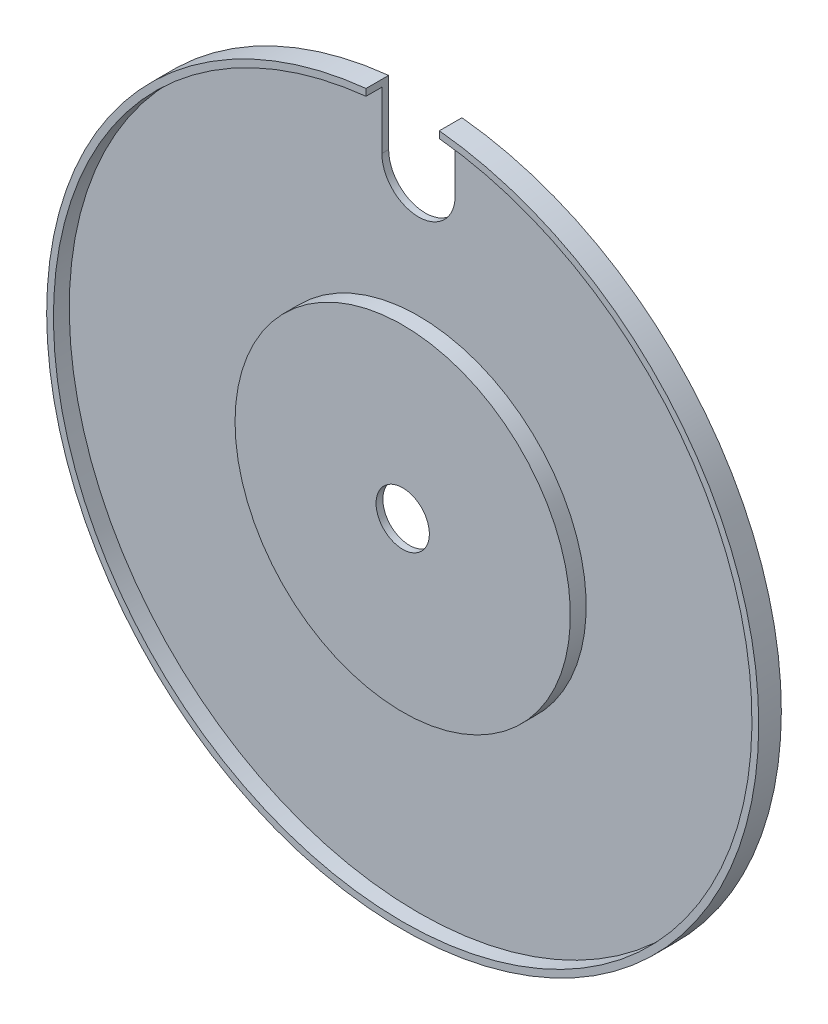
ISO-10303-21;
HEADER;
FILE_DESCRIPTION(('STEP AP214'),'2;1');
FILE_NAME('part.step','',(''),(''),'','','');
FILE_SCHEMA(('AUTOMOTIVE_DESIGN { 1 0 10303 214 1 1 1 1 }'));
ENDSEC;
DATA;
#1=APPLICATION_CONTEXT('core data for automotive mechanical design processes');
#2=APPLICATION_PROTOCOL_DEFINITION('international standard','automotive_design',2000,#1);
#3=PRODUCT_CONTEXT('',#1,'mechanical');
#4=PRODUCT('Part','Part','',(#3));
#5=PRODUCT_RELATED_PRODUCT_CATEGORY('part','',(#4));
#6=PRODUCT_DEFINITION_FORMATION('','',#4);
#7=PRODUCT_DEFINITION_CONTEXT('part definition',#1,'design');
#8=PRODUCT_DEFINITION('design','',#6,#7);
#9=PRODUCT_DEFINITION_SHAPE('','',#8);
#10=(LENGTH_UNIT() NAMED_UNIT(*) SI_UNIT(.MILLI.,.METRE.));
#11=(NAMED_UNIT(*) PLANE_ANGLE_UNIT() SI_UNIT($,.RADIAN.));
#12=(NAMED_UNIT(*) SI_UNIT($,.STERADIAN.) SOLID_ANGLE_UNIT());
#13=UNCERTAINTY_MEASURE_WITH_UNIT(LENGTH_MEASURE(1.E-05),#10,'distance_accuracy_value','');
#14=(GEOMETRIC_REPRESENTATION_CONTEXT(3) GLOBAL_UNCERTAINTY_ASSIGNED_CONTEXT((#13)) GLOBAL_UNIT_ASSIGNED_CONTEXT((#10,
#11,#12)) REPRESENTATION_CONTEXT('',''));
#15=CARTESIAN_POINT('',(0.,0.,0.));
#16=DIRECTION('',(0.,0.,1.));
#17=DIRECTION('',(1.,0.,0.));
#18=AXIS2_PLACEMENT_3D('',#15,#16,#17);
#19=CARTESIAN_POINT('',(0.,0.,1.93523572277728));
#20=DIRECTION('',(0.,0.,1.));
#21=DIRECTION('',(1.,0.,0.));
#22=AXIS2_PLACEMENT_3D('',#19,#20,#21);
#23=PLANE('',#22);
#24=DIRECTION('',(0.,-1.,0.));
#25=VECTOR('',#24,1.);
#26=CARTESIAN_POINT('',(-4.11854366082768,0.,1.93523572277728));
#27=LINE('',#26,#25);
#28=CARTESIAN_POINT('',(-4.11854366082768,39.7924317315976,1.93523572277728));
#29=VERTEX_POINT('',#28);
#30=CARTESIAN_POINT('',(-4.11854366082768,39.0262814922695,1.93523572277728));
#31=VERTEX_POINT('',#30);
#32=EDGE_CURVE('E152',#29,#31,#27,.T.);
#33=ORIENTED_EDGE('',*,*,#32,.F.);
#34=CARTESIAN_POINT('',(0.,0.,1.93523572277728));
#35=DIRECTION('',(0.,0.,-1.));
#36=DIRECTION('',(-1.,0.,0.));
#37=AXIS2_PLACEMENT_3D('',#34,#35,#36);
#38=CIRCLE('',#37,40.005);
#39=CARTESIAN_POINT('',(4.11854366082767,39.7924317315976,1.93523572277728));
#40=VERTEX_POINT('',#39);
#41=EDGE_CURVE('E136',#40,#29,#38,.T.);
#42=ORIENTED_EDGE('',*,*,#41,.F.);
#43=DIRECTION('',(0.,1.,0.));
#44=VECTOR('',#43,1.);
#45=CARTESIAN_POINT('',(4.11854366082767,0.,1.93523572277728));
#46=LINE('',#45,#44);
#47=CARTESIAN_POINT('',(4.11854366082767,39.0262814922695,1.93523572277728));
#48=VERTEX_POINT('',#47);
#49=EDGE_CURVE('E153',#48,#40,#46,.T.);
#50=ORIENTED_EDGE('',*,*,#49,.F.);
#51=CARTESIAN_POINT('',(0.,0.,1.93523572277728));
#52=DIRECTION('',(0.,0.,1.));
#53=DIRECTION('',(1.,0.,0.));
#54=AXIS2_PLACEMENT_3D('',#51,#52,#53);
#55=CIRCLE('',#54,39.243);
#56=EDGE_CURVE('E123',#48,#31,#55,.F.);
#57=ORIENTED_EDGE('',*,*,#56,.T.);
#58=EDGE_LOOP('',(#33,#42,#50,#57));
#59=FACE_BOUND('',#58,.T.);
#60=ADVANCED_FACE('F35',(#59),#23,.T.);
#61=CARTESIAN_POINT('',(-18.0769629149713,0.,-0.604764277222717));
#62=DIRECTION('',(0.,0.,-1.));
#63=DIRECTION('',(-1.,0.,0.));
#64=AXIS2_PLACEMENT_3D('',#61,#62,#63);
#65=PLANE('',#64);
#66=DIRECTION('',(0.,1.,0.));
#67=VECTOR('',#66,1.);
#68=CARTESIAN_POINT('',(-4.11854366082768,0.,-0.604764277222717));
#69=LINE('',#68,#67);
#70=CARTESIAN_POINT('',(-4.11854366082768,32.577228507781,-0.604764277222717));
#71=VERTEX_POINT('',#70);
#72=CARTESIAN_POINT('',(-4.11854366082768,39.7924317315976,-0.604764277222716));
#73=VERTEX_POINT('',#72);
#74=EDGE_CURVE('E58',#71,#73,#69,.T.);
#75=ORIENTED_EDGE('',*,*,#74,.F.);
#76=CARTESIAN_POINT('',(0.,32.577228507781,-0.604764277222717));
#77=DIRECTION('',(0.,0.,-1.));
#78=DIRECTION('',(-1.,0.,0.));
#79=AXIS2_PLACEMENT_3D('',#76,#77,#78);
#80=CIRCLE('',#79,4.11854366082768);
#81=CARTESIAN_POINT('',(4.11854366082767,32.577228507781,-0.604764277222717));
#82=VERTEX_POINT('',#81);
#83=EDGE_CURVE('E103',#82,#71,#80,.T.);
#84=ORIENTED_EDGE('',*,*,#83,.F.);
#85=DIRECTION('',(0.,-1.,0.));
#86=VECTOR('',#85,1.);
#87=CARTESIAN_POINT('',(4.11854366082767,0.,-0.604764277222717));
#88=LINE('',#87,#86);
#89=CARTESIAN_POINT('',(4.11854366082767,39.7924317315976,-0.604764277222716));
#90=VERTEX_POINT('',#89);
#91=EDGE_CURVE('E88',#90,#82,#88,.T.);
#92=ORIENTED_EDGE('',*,*,#91,.F.);
#93=CARTESIAN_POINT('',(0.,0.,-0.604764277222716));
#94=DIRECTION('',(0.,0.,-1.));
#95=DIRECTION('',(-1.,0.,0.));
#96=AXIS2_PLACEMENT_3D('',#93,#94,#95);
#97=CIRCLE('',#96,40.005);
#98=EDGE_CURVE('E139',#90,#73,#97,.T.);
#99=ORIENTED_EDGE('',*,*,#98,.T.);
#100=EDGE_LOOP('',(#75,#84,#92,#99));
#101=FACE_BOUND('',#100,.T.);
#102=CARTESIAN_POINT('',(0.,0.,-0.604764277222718));
#103=DIRECTION('',(0.,0.,-1.));
#104=DIRECTION('',(-1.,0.,0.));
#105=AXIS2_PLACEMENT_3D('',#102,#103,#104);
#106=CIRCLE('',#105,18.0769629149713);
#107=CARTESIAN_POINT('',(-18.0769629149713,0.,-0.604764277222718));
#108=VERTEX_POINT('',#107);
#109=EDGE_CURVE('E122',#108,#108,#106,.T.);
#110=ORIENTED_EDGE('',*,*,#109,.F.);
#111=EDGE_LOOP('',(#110));
#112=FACE_BOUND('',#111,.T.);
#113=ADVANCED_FACE('F37',(#101,#112),#65,.T.);
#114=CARTESIAN_POINT('',(0.,0.,1.17323572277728));
#115=DIRECTION('',(0.,0.,-1.));
#116=DIRECTION('',(-1.,0.,0.));
#117=AXIS2_PLACEMENT_3D('',#114,#115,#116);
#118=CYLINDRICAL_SURFACE('',#117,40.005);
#119=DIRECTION('',(0.,0.,-1.));
#120=VECTOR('',#119,1.);
#121=CARTESIAN_POINT('',(-4.11854366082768,39.7924317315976,1.17323572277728));
#122=LINE('',#121,#120);
#123=EDGE_CURVE('E112',#73,#29,#122,.F.);
#124=ORIENTED_EDGE('',*,*,#123,.F.);
#125=ORIENTED_EDGE('',*,*,#98,.F.);
#126=DIRECTION('',(0.,0.,-1.));
#127=VECTOR('',#126,1.);
#128=CARTESIAN_POINT('',(4.11854366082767,39.7924317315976,1.17323572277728));
#129=LINE('',#128,#127);
#130=EDGE_CURVE('E93',#40,#90,#129,.T.);
#131=ORIENTED_EDGE('',*,*,#130,.F.);
#132=ORIENTED_EDGE('',*,*,#41,.T.);
#133=EDGE_LOOP('',(#124,#125,#131,#132));
#134=FACE_BOUND('',#133,.T.);
#135=ADVANCED_FACE('F161',(#134),#118,.T.);
#136=CARTESIAN_POINT('',(-18.0769629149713,0.,1.17323572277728));
#137=DIRECTION('',(0.,0.,-1.));
#138=DIRECTION('',(-1.,0.,0.));
#139=AXIS2_PLACEMENT_3D('',#136,#137,#138);
#140=PLANE('',#139);
#141=CARTESIAN_POINT('',(0.,0.,1.17323572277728));
#142=DIRECTION('',(0.,0.,-1.));
#143=DIRECTION('',(-1.,0.,0.));
#144=AXIS2_PLACEMENT_3D('',#141,#142,#143);
#145=CIRCLE('',#144,2.99251043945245);
#146=CARTESIAN_POINT('',(-2.99251043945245,0.,1.17323572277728));
#147=VERTEX_POINT('',#146);
#148=EDGE_CURVE('E110',#147,#147,#145,.T.);
#149=ORIENTED_EDGE('',*,*,#148,.F.);
#150=EDGE_LOOP('',(#149));
#151=FACE_BOUND('',#150,.T.);
#152=CARTESIAN_POINT('',(0.,0.,1.17323572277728));
#153=DIRECTION('',(0.,0.,-1.));
#154=DIRECTION('',(-1.,0.,0.));
#155=AXIS2_PLACEMENT_3D('',#152,#153,#154);
#156=CIRCLE('',#155,18.0769629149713);
#157=CARTESIAN_POINT('',(-18.0769629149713,0.,1.17323572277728));
#158=VERTEX_POINT('',#157);
#159=EDGE_CURVE('E133',#158,#158,#156,.T.);
#160=ORIENTED_EDGE('',*,*,#159,.T.);
#161=EDGE_LOOP('',(#160));
#162=FACE_BOUND('',#161,.T.);
#163=ADVANCED_FACE('F163',(#151,#162),#140,.T.);
#164=CARTESIAN_POINT('',(0.,0.,1.17323572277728));
#165=DIRECTION('',(0.,0.,-1.));
#166=DIRECTION('',(-1.,0.,0.));
#167=AXIS2_PLACEMENT_3D('',#164,#165,#166);
#168=CYLINDRICAL_SURFACE('',#167,18.0769629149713);
#169=ORIENTED_EDGE('',*,*,#109,.T.);
#170=EDGE_LOOP('',(#169));
#171=FACE_BOUND('',#170,.T.);
#172=ORIENTED_EDGE('',*,*,#159,.F.);
#173=EDGE_LOOP('',(#172));
#174=FACE_BOUND('',#173,.T.);
#175=ADVANCED_FACE('F168',(#171,#174),#168,.F.);
#176=CARTESIAN_POINT('',(-18.0769629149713,0.,0.157235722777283));
#177=DIRECTION('',(0.,0.,-1.));
#178=DIRECTION('',(-1.,0.,0.));
#179=AXIS2_PLACEMENT_3D('',#176,#177,#178);
#180=PLANE('',#179);
#181=CARTESIAN_POINT('',(0.,32.577228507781,0.157235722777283));
#182=DIRECTION('',(0.,0.,-1.));
#183=DIRECTION('',(-1.,0.,0.));
#184=AXIS2_PLACEMENT_3D('',#181,#182,#183);
#185=CIRCLE('',#184,4.11854366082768);
#186=CARTESIAN_POINT('',(4.11854366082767,32.577228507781,0.157235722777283));
#187=VERTEX_POINT('',#186);
#188=CARTESIAN_POINT('',(-4.11854366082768,32.577228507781,0.157235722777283));
#189=VERTEX_POINT('',#188);
#190=EDGE_CURVE('E11',#187,#189,#185,.T.);
#191=ORIENTED_EDGE('',*,*,#190,.T.);
#192=DIRECTION('',(0.,1.,0.));
#193=VECTOR('',#192,1.);
#194=CARTESIAN_POINT('',(-4.11854366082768,0.,0.157235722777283));
#195=LINE('',#194,#193);
#196=CARTESIAN_POINT('',(-4.11854366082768,39.0262814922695,0.157235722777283));
#197=VERTEX_POINT('',#196);
#198=EDGE_CURVE('E98',#189,#197,#195,.T.);
#199=ORIENTED_EDGE('',*,*,#198,.T.);
#200=CARTESIAN_POINT('',(0.,0.,0.157235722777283));
#201=DIRECTION('',(0.,0.,-1.));
#202=DIRECTION('',(-1.,0.,0.));
#203=AXIS2_PLACEMENT_3D('',#200,#201,#202);
#204=CIRCLE('',#203,39.243);
#205=CARTESIAN_POINT('',(4.11854366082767,39.0262814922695,0.157235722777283));
#206=VERTEX_POINT('',#205);
#207=EDGE_CURVE('E119',#206,#197,#204,.T.);
#208=ORIENTED_EDGE('',*,*,#207,.F.);
#209=DIRECTION('',(0.,-1.,0.));
#210=VECTOR('',#209,1.);
#211=CARTESIAN_POINT('',(4.11854366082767,0.,0.157235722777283));
#212=LINE('',#211,#210);
#213=EDGE_CURVE('E50',#206,#187,#212,.T.);
#214=ORIENTED_EDGE('',*,*,#213,.T.);
#215=EDGE_LOOP('',(#191,#199,#208,#214));
#216=FACE_BOUND('',#215,.T.);
#217=CARTESIAN_POINT('',(0.,0.,0.157235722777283));
#218=DIRECTION('',(0.,0.,-1.));
#219=DIRECTION('',(-1.,0.,0.));
#220=AXIS2_PLACEMENT_3D('',#217,#218,#219);
#221=CIRCLE('',#220,18.8389629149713);
#222=CARTESIAN_POINT('',(-18.8389629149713,0.,0.157235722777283));
#223=VERTEX_POINT('',#222);
#224=EDGE_CURVE('E118',#223,#223,#221,.T.);
#225=ORIENTED_EDGE('',*,*,#224,.T.);
#226=EDGE_LOOP('',(#225));
#227=FACE_BOUND('',#226,.T.);
#228=ADVANCED_FACE('F178',(#216,#227),#180,.F.);
#229=CARTESIAN_POINT('',(0.,0.,1.17323572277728));
#230=DIRECTION('',(0.,0.,-1.));
#231=DIRECTION('',(-1.,0.,0.));
#232=AXIS2_PLACEMENT_3D('',#229,#230,#231);
#233=CYLINDRICAL_SURFACE('',#232,39.243);
#234=ORIENTED_EDGE('',*,*,#207,.T.);
#235=DIRECTION('',(0.,0.,-1.));
#236=VECTOR('',#235,1.);
#237=CARTESIAN_POINT('',(-4.11854366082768,39.0262814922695,1.17323572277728));
#238=LINE('',#237,#236);
#239=EDGE_CURVE('E43',#197,#31,#238,.F.);
#240=ORIENTED_EDGE('',*,*,#239,.T.);
#241=ORIENTED_EDGE('',*,*,#56,.F.);
#242=DIRECTION('',(0.,0.,-1.));
#243=VECTOR('',#242,1.);
#244=CARTESIAN_POINT('',(4.11854366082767,39.0262814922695,1.17323572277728));
#245=LINE('',#244,#243);
#246=EDGE_CURVE('E140',#48,#206,#245,.T.);
#247=ORIENTED_EDGE('',*,*,#246,.T.);
#248=EDGE_LOOP('',(#234,#240,#241,#247));
#249=FACE_BOUND('',#248,.T.);
#250=ADVANCED_FACE('F145',(#249),#233,.F.);
#251=CARTESIAN_POINT('',(-18.0769629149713,0.,1.93523572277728));
#252=DIRECTION('',(0.,0.,-1.));
#253=DIRECTION('',(-1.,0.,0.));
#254=AXIS2_PLACEMENT_3D('',#251,#252,#253);
#255=PLANE('',#254);
#256=CARTESIAN_POINT('',(0.,0.,1.93523572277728));
#257=DIRECTION('',(0.,0.,-1.));
#258=DIRECTION('',(-1.,0.,0.));
#259=AXIS2_PLACEMENT_3D('',#256,#257,#258);
#260=CIRCLE('',#259,2.99251043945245);
#261=CARTESIAN_POINT('',(-2.99251043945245,0.,1.93523572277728));
#262=VERTEX_POINT('',#261);
#263=EDGE_CURVE('E107',#262,#262,#260,.T.);
#264=ORIENTED_EDGE('',*,*,#263,.T.);
#265=EDGE_LOOP('',(#264));
#266=FACE_BOUND('',#265,.T.);
#267=CARTESIAN_POINT('',(0.,0.,1.93523572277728));
#268=DIRECTION('',(0.,0.,-1.));
#269=DIRECTION('',(-1.,0.,0.));
#270=AXIS2_PLACEMENT_3D('',#267,#268,#269);
#271=CIRCLE('',#270,18.8389629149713);
#272=CARTESIAN_POINT('',(-18.8389629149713,0.,1.93523572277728));
#273=VERTEX_POINT('',#272);
#274=EDGE_CURVE('E126',#273,#273,#271,.T.);
#275=ORIENTED_EDGE('',*,*,#274,.F.);
#276=EDGE_LOOP('',(#275));
#277=FACE_BOUND('',#276,.T.);
#278=ADVANCED_FACE('F184',(#266,#277),#255,.F.);
#279=CARTESIAN_POINT('',(0.,0.,1.17323572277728));
#280=DIRECTION('',(0.,0.,-1.));
#281=DIRECTION('',(-1.,0.,0.));
#282=AXIS2_PLACEMENT_3D('',#279,#280,#281);
#283=CYLINDRICAL_SURFACE('',#282,18.8389629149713);
#284=ORIENTED_EDGE('',*,*,#224,.F.);
#285=EDGE_LOOP('',(#284));
#286=FACE_BOUND('',#285,.T.);
#287=ORIENTED_EDGE('',*,*,#274,.T.);
#288=EDGE_LOOP('',(#287));
#289=FACE_BOUND('',#288,.T.);
#290=ADVANCED_FACE('F180',(#286,#289),#283,.T.);
#291=CARTESIAN_POINT('',(0.,0.,-6.858));
#292=DIRECTION('',(0.,0.,1.));
#293=DIRECTION('',(1.,0.,0.));
#294=AXIS2_PLACEMENT_3D('',#291,#292,#293);
#295=CYLINDRICAL_SURFACE('',#294,2.99251043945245);
#296=ORIENTED_EDGE('',*,*,#148,.T.);
#297=EDGE_LOOP('',(#296));
#298=FACE_BOUND('',#297,.T.);
#299=ORIENTED_EDGE('',*,*,#263,.F.);
#300=EDGE_LOOP('',(#299));
#301=FACE_BOUND('',#300,.T.);
#302=ADVANCED_FACE('F183',(#298,#301),#295,.F.);
#303=CARTESIAN_POINT('',(0.,32.577228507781,-6.858));
#304=DIRECTION('',(0.,0.,1.));
#305=DIRECTION('',(1.,0.,0.));
#306=AXIS2_PLACEMENT_3D('',#303,#304,#305);
#307=CYLINDRICAL_SURFACE('',#306,4.11854366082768);
#308=ORIENTED_EDGE('',*,*,#83,.T.);
#309=DIRECTION('',(0.,0.,1.));
#310=VECTOR('',#309,1.);
#311=CARTESIAN_POINT('',(-4.11854366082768,32.577228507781,-6.858));
#312=LINE('',#311,#310);
#313=EDGE_CURVE('E104',#71,#189,#312,.T.);
#314=ORIENTED_EDGE('',*,*,#313,.T.);
#315=ORIENTED_EDGE('',*,*,#190,.F.);
#316=DIRECTION('',(0.,0.,1.));
#317=VECTOR('',#316,1.);
#318=CARTESIAN_POINT('',(4.11854366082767,32.577228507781,-6.858));
#319=LINE('',#318,#317);
#320=EDGE_CURVE('E91',#82,#187,#319,.T.);
#321=ORIENTED_EDGE('',*,*,#320,.F.);
#322=EDGE_LOOP('',(#308,#314,#315,#321));
#323=FACE_BOUND('',#322,.T.);
#324=ADVANCED_FACE('F101',(#323),#307,.F.);
#325=CARTESIAN_POINT('',(-4.11854366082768,32.577228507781,-6.858));
#326=DIRECTION('',(-1.,0.,0.));
#327=DIRECTION('',(0.,0.,1.));
#328=AXIS2_PLACEMENT_3D('',#325,#326,#327);
#329=PLANE('',#328);
#330=ORIENTED_EDGE('',*,*,#74,.T.);
#331=ORIENTED_EDGE('',*,*,#123,.T.);
#332=ORIENTED_EDGE('',*,*,#32,.T.);
#333=ORIENTED_EDGE('',*,*,#239,.F.);
#334=ORIENTED_EDGE('',*,*,#198,.F.);
#335=ORIENTED_EDGE('',*,*,#313,.F.);
#336=EDGE_LOOP('',(#330,#331,#332,#333,#334,#335));
#337=FACE_BOUND('',#336,.T.);
#338=ADVANCED_FACE('F159',(#337),#329,.F.);
#339=CARTESIAN_POINT('',(4.11854366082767,44.8616475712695,-6.858));
#340=DIRECTION('',(1.,0.,0.));
#341=DIRECTION('',(0.,0.,-1.));
#342=AXIS2_PLACEMENT_3D('',#339,#340,#341);
#343=PLANE('',#342);
#344=ORIENTED_EDGE('',*,*,#91,.T.);
#345=ORIENTED_EDGE('',*,*,#320,.T.);
#346=ORIENTED_EDGE('',*,*,#213,.F.);
#347=ORIENTED_EDGE('',*,*,#246,.F.);
#348=ORIENTED_EDGE('',*,*,#49,.T.);
#349=ORIENTED_EDGE('',*,*,#130,.T.);
#350=EDGE_LOOP('',(#344,#345,#346,#347,#348,#349));
#351=FACE_BOUND('',#350,.T.);
#352=ADVANCED_FACE('F90',(#351),#343,.F.);
#353=CLOSED_SHELL('',(#60,#113,#135,#163,#175,#228,#250,#278,#290,#302,#324,#338,#352));
#354=MANIFOLD_SOLID_BREP('B2',#353);
#355=ADVANCED_BREP_SHAPE_REPRESENTATION('',(#18,#354),#14);
#356=SHAPE_DEFINITION_REPRESENTATION(#9,#355);
ENDSEC;
END-ISO-10303-21;
